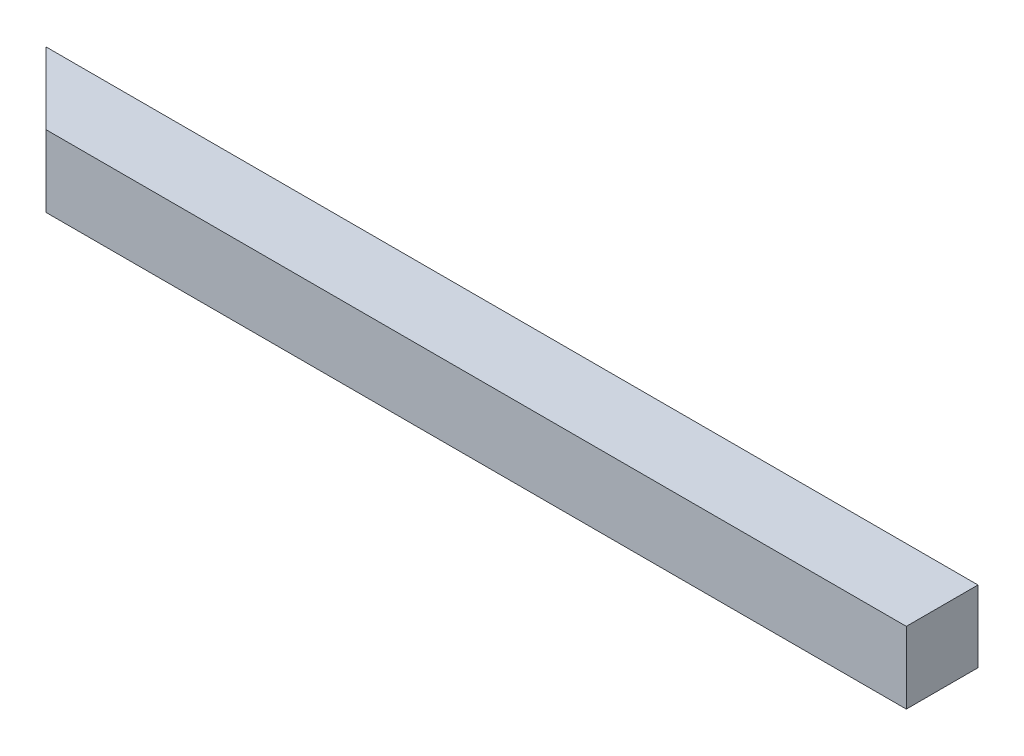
ISO-10303-21;
HEADER;
FILE_DESCRIPTION(('STEP AP214'),'2;1');
FILE_NAME('part.step','',(''),(''),'','','');
FILE_SCHEMA(('AUTOMOTIVE_DESIGN { 1 0 10303 214 1 1 1 1 }'));
ENDSEC;
DATA;
#1=APPLICATION_CONTEXT('core data for automotive mechanical design processes');
#2=APPLICATION_PROTOCOL_DEFINITION('international standard','automotive_design',2000,#1);
#3=PRODUCT_CONTEXT('',#1,'mechanical');
#4=PRODUCT('Part','Part','',(#3));
#5=PRODUCT_RELATED_PRODUCT_CATEGORY('part','',(#4));
#6=PRODUCT_DEFINITION_FORMATION('','',#4);
#7=PRODUCT_DEFINITION_CONTEXT('part definition',#1,'design');
#8=PRODUCT_DEFINITION('design','',#6,#7);
#9=PRODUCT_DEFINITION_SHAPE('','',#8);
#10=(LENGTH_UNIT() NAMED_UNIT(*) SI_UNIT(.MILLI.,.METRE.));
#11=(NAMED_UNIT(*) PLANE_ANGLE_UNIT() SI_UNIT($,.RADIAN.));
#12=(NAMED_UNIT(*) SI_UNIT($,.STERADIAN.) SOLID_ANGLE_UNIT());
#13=UNCERTAINTY_MEASURE_WITH_UNIT(LENGTH_MEASURE(1.E-05),#10,'distance_accuracy_value','');
#14=(GEOMETRIC_REPRESENTATION_CONTEXT(3) GLOBAL_UNCERTAINTY_ASSIGNED_CONTEXT((#13)) GLOBAL_UNIT_ASSIGNED_CONTEXT((#10,
#11,#12)) REPRESENTATION_CONTEXT('',''));
#15=CARTESIAN_POINT('',(0.,0.,0.));
#16=DIRECTION('',(0.,0.,1.));
#17=DIRECTION('',(1.,0.,0.));
#18=AXIS2_PLACEMENT_3D('',#15,#16,#17);
#19=CARTESIAN_POINT('',(120.,20.,-10.));
#20=DIRECTION('',(-1.,0.,0.));
#21=DIRECTION('',(0.,0.,1.));
#22=AXIS2_PLACEMENT_3D('',#19,#20,#21);
#23=PLANE('',#22);
#24=DIRECTION('',(0.,0.,-1.));
#25=VECTOR('',#24,1.);
#26=CARTESIAN_POINT('',(120.,0.,-10.));
#27=LINE('',#26,#25);
#28=CARTESIAN_POINT('',(120.,0.,10.));
#29=VERTEX_POINT('',#28);
#30=CARTESIAN_POINT('',(120.,0.,-10.));
#31=VERTEX_POINT('',#30);
#32=EDGE_CURVE('E96',#29,#31,#27,.T.);
#33=ORIENTED_EDGE('',*,*,#32,.T.);
#34=DIRECTION('',(0.,-1.,0.));
#35=VECTOR('',#34,1.);
#36=CARTESIAN_POINT('',(120.,20.,-10.));
#37=LINE('',#36,#35);
#38=CARTESIAN_POINT('',(120.,20.,-10.));
#39=VERTEX_POINT('',#38);
#40=EDGE_CURVE('E11',#39,#31,#37,.T.);
#41=ORIENTED_EDGE('',*,*,#40,.F.);
#42=DIRECTION('',(0.,0.,-1.));
#43=VECTOR('',#42,1.);
#44=CARTESIAN_POINT('',(120.,20.,-10.));
#45=LINE('',#44,#43);
#46=CARTESIAN_POINT('',(120.,20.,10.));
#47=VERTEX_POINT('',#46);
#48=EDGE_CURVE('E84',#47,#39,#45,.T.);
#49=ORIENTED_EDGE('',*,*,#48,.F.);
#50=DIRECTION('',(0.,-1.,0.));
#51=VECTOR('',#50,1.);
#52=CARTESIAN_POINT('',(120.,20.,10.));
#53=LINE('',#52,#51);
#54=EDGE_CURVE('E92',#47,#29,#53,.T.);
#55=ORIENTED_EDGE('',*,*,#54,.T.);
#56=EDGE_LOOP('',(#33,#41,#49,#55));
#57=FACE_BOUND('',#56,.T.);
#58=ADVANCED_FACE('F33',(#57),#23,.F.);
#59=CARTESIAN_POINT('',(-120.,20.,-10.));
#60=DIRECTION('',(0.,0.,1.));
#61=DIRECTION('',(1.,0.,0.));
#62=AXIS2_PLACEMENT_3D('',#59,#60,#61);
#63=PLANE('',#62);
#64=DIRECTION('',(-1.,0.,0.));
#65=VECTOR('',#64,1.);
#66=CARTESIAN_POINT('',(-120.,0.,-10.));
#67=LINE('',#66,#65);
#68=CARTESIAN_POINT('',(-140.,0.,-10.));
#69=VERTEX_POINT('',#68);
#70=EDGE_CURVE('E88',#31,#69,#67,.T.);
#71=ORIENTED_EDGE('',*,*,#70,.T.);
#72=DIRECTION('',(0.,-1.,0.));
#73=VECTOR('',#72,1.);
#74=CARTESIAN_POINT('',(-140.,20.,-10.));
#75=LINE('',#74,#73);
#76=CARTESIAN_POINT('',(-140.,20.,-10.));
#77=VERTEX_POINT('',#76);
#78=EDGE_CURVE('E41',#77,#69,#75,.T.);
#79=ORIENTED_EDGE('',*,*,#78,.F.);
#80=DIRECTION('',(-1.,0.,0.));
#81=VECTOR('',#80,1.);
#82=CARTESIAN_POINT('',(-120.,20.,-10.));
#83=LINE('',#82,#81);
#84=EDGE_CURVE('E79',#39,#77,#83,.T.);
#85=ORIENTED_EDGE('',*,*,#84,.F.);
#86=ORIENTED_EDGE('',*,*,#40,.T.);
#87=EDGE_LOOP('',(#71,#79,#85,#86));
#88=FACE_BOUND('',#87,.T.);
#89=ADVANCED_FACE('F87',(#88),#63,.F.);
#90=CARTESIAN_POINT('',(-120.,20.,10.));
#91=DIRECTION('',(0.707106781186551,0.,-0.707106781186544));
#92=DIRECTION('',(-0.707106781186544,0.,-0.707106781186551));
#93=AXIS2_PLACEMENT_3D('',#90,#91,#92);
#94=PLANE('',#93);
#95=DIRECTION('',(0.707106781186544,0.,0.707106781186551));
#96=VECTOR('',#95,1.);
#97=CARTESIAN_POINT('',(-120.,0.,10.));
#98=LINE('',#97,#96);
#99=CARTESIAN_POINT('',(-120.,0.,10.));
#100=VERTEX_POINT('',#99);
#101=EDGE_CURVE('E66',#69,#100,#98,.T.);
#102=ORIENTED_EDGE('',*,*,#101,.T.);
#103=DIRECTION('',(0.,-1.,0.));
#104=VECTOR('',#103,1.);
#105=CARTESIAN_POINT('',(-120.,20.,10.));
#106=LINE('',#105,#104);
#107=CARTESIAN_POINT('',(-120.,20.,10.));
#108=VERTEX_POINT('',#107);
#109=EDGE_CURVE('E89',#108,#100,#106,.T.);
#110=ORIENTED_EDGE('',*,*,#109,.F.);
#111=DIRECTION('',(0.707106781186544,0.,0.707106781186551));
#112=VECTOR('',#111,1.);
#113=CARTESIAN_POINT('',(-120.,20.,10.));
#114=LINE('',#113,#112);
#115=EDGE_CURVE('E82',#77,#108,#114,.T.);
#116=ORIENTED_EDGE('',*,*,#115,.F.);
#117=ORIENTED_EDGE('',*,*,#78,.T.);
#118=EDGE_LOOP('',(#102,#110,#116,#117));
#119=FACE_BOUND('',#118,.T.);
#120=ADVANCED_FACE('F90',(#119),#94,.F.);
#121=CARTESIAN_POINT('',(-120.,20.,10.));
#122=DIRECTION('',(0.,0.,-1.));
#123=DIRECTION('',(-1.,0.,0.));
#124=AXIS2_PLACEMENT_3D('',#121,#122,#123);
#125=PLANE('',#124);
#126=DIRECTION('',(1.,0.,0.));
#127=VECTOR('',#126,1.);
#128=CARTESIAN_POINT('',(-120.,0.,10.));
#129=LINE('',#128,#127);
#130=EDGE_CURVE('E72',#100,#29,#129,.T.);
#131=ORIENTED_EDGE('',*,*,#130,.T.);
#132=ORIENTED_EDGE('',*,*,#54,.F.);
#133=DIRECTION('',(1.,0.,0.));
#134=VECTOR('',#133,1.);
#135=CARTESIAN_POINT('',(-120.,20.,10.));
#136=LINE('',#135,#134);
#137=EDGE_CURVE('E49',#108,#47,#136,.T.);
#138=ORIENTED_EDGE('',*,*,#137,.F.);
#139=ORIENTED_EDGE('',*,*,#109,.T.);
#140=EDGE_LOOP('',(#131,#132,#138,#139));
#141=FACE_BOUND('',#140,.T.);
#142=ADVANCED_FACE('F103',(#141),#125,.F.);
#143=CARTESIAN_POINT('',(0.,20.,0.));
#144=DIRECTION('',(0.,1.,0.));
#145=DIRECTION('',(0.,0.,1.));
#146=AXIS2_PLACEMENT_3D('',#143,#144,#145);
#147=PLANE('',#146);
#148=ORIENTED_EDGE('',*,*,#48,.T.);
#149=ORIENTED_EDGE('',*,*,#84,.T.);
#150=ORIENTED_EDGE('',*,*,#115,.T.);
#151=ORIENTED_EDGE('',*,*,#137,.T.);
#152=EDGE_LOOP('',(#148,#149,#150,#151));
#153=FACE_BOUND('',#152,.T.);
#154=ADVANCED_FACE('F80',(#153),#147,.T.);
#155=CARTESIAN_POINT('',(0.,0.,0.));
#156=DIRECTION('',(0.,1.,0.));
#157=DIRECTION('',(0.,0.,1.));
#158=AXIS2_PLACEMENT_3D('',#155,#156,#157);
#159=PLANE('',#158);
#160=ORIENTED_EDGE('',*,*,#32,.F.);
#161=ORIENTED_EDGE('',*,*,#130,.F.);
#162=ORIENTED_EDGE('',*,*,#101,.F.);
#163=ORIENTED_EDGE('',*,*,#70,.F.);
#164=EDGE_LOOP('',(#160,#161,#162,#163));
#165=FACE_BOUND('',#164,.T.);
#166=ADVANCED_FACE('F106',(#165),#159,.F.);
#167=CLOSED_SHELL('',(#58,#89,#120,#142,#154,#166));
#168=MANIFOLD_SOLID_BREP('B2',#167);
#169=ADVANCED_BREP_SHAPE_REPRESENTATION('',(#18,#168),#14);
#170=SHAPE_DEFINITION_REPRESENTATION(#9,#169);
ENDSEC;
END-ISO-10303-21;
